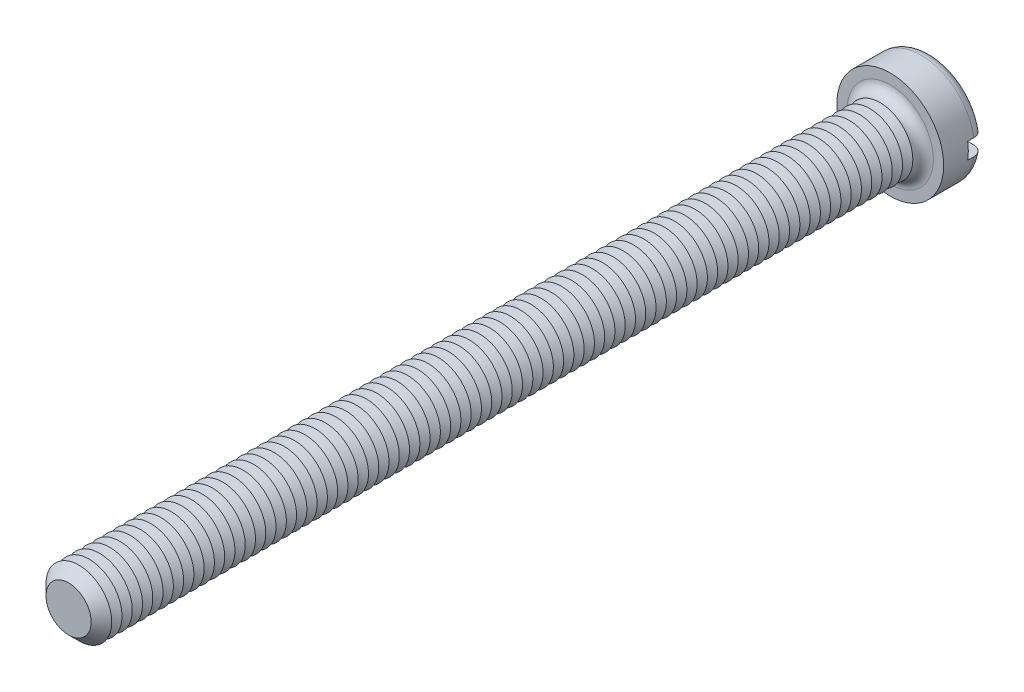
from build123d import *

# Parameters (mm, degrees)
SKETCH3_R           = 6.5
BOSS_EXTRUDE2_DEPTH = 5
SKETCH4_R           = 4
BOSS_EXTRUDE3_DEPTH = 100
FILLET1_R           = 1.25
CHAMFER1_SIZE       = 1.25
LPATTERN1_COUNT     = 78
LPATTERN1_PITCH     = 1.25
SKETCH8_W           = 13
SKETCH8_H           = 2
CUT_EXTRUDE1_DEPTH  = 2


with BuildPart() as part:
    # Sketch3 → Boss-Extrude2 (new body)
    with BuildSketch(Plane.XY):
        Circle(SKETCH3_R)
    extrude(amount=-BOSS_EXTRUDE2_DEPTH)

    # Sketch4 → Boss-Extrude3 (add)
    with BuildSketch(Plane.XY):
        Circle(SKETCH4_R)
    extrude(amount=BOSS_EXTRUDE3_DEPTH)

    # Fillet1
    fillet1_edges = [part.edges().sort_by_distance(p)[0] for p in [
        (-6.5, 0, -5),
        (-4, 0, 0),
    ]]
    fillet(fillet1_edges, radius=FILLET1_R)

    # Chamfer1
    chamfer1_edges = [part.edges().sort_by_distance(p)[0] for p in [
        (-4, 0, 100),
    ]]
    chamfer(chamfer1_edges, length=CHAMFER1_SIZE)

    # Sketch6 → Cut-Revolve1 (revolve, cut)
    with BuildSketch(Plane(origin=(0, 0, 0), x_dir=(0, 0, -1), z_dir=(1, 0, 0)), mode=Mode.PRIVATE) as cut_revolve1_sk:
        Polygon((-1.25, 4), (-1.875, 2.917468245), (-2.5, 4), align=None)
    cut_revolve1 = revolve(cut_revolve1_sk.sketch.rotate(Axis((0, 0, -1.694361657), (0, 0, 1)), 90), axis=Axis((0, 0, -1.694361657), (0, 0, 1)), mode=Mode.SUBTRACT)

    # LPattern1: Cut-Revolve1 ×78
    with Locations(*[(0, 0, i * LPATTERN1_PITCH) for i in range(1, LPATTERN1_COUNT)]):
        add(cut_revolve1, mode=Mode.SUBTRACT)

    # Sketch8 → Cut-Extrude1 (cut)
    with BuildSketch(Plane(origin=(0, 0, -5), x_dir=(-1, 0, 0), z_dir=(0, 0, -1))):
        Rectangle(SKETCH8_W, SKETCH8_H)
    extrude(amount=-CUT_EXTRUDE1_DEPTH, mode=Mode.SUBTRACT)


solid = part.part
